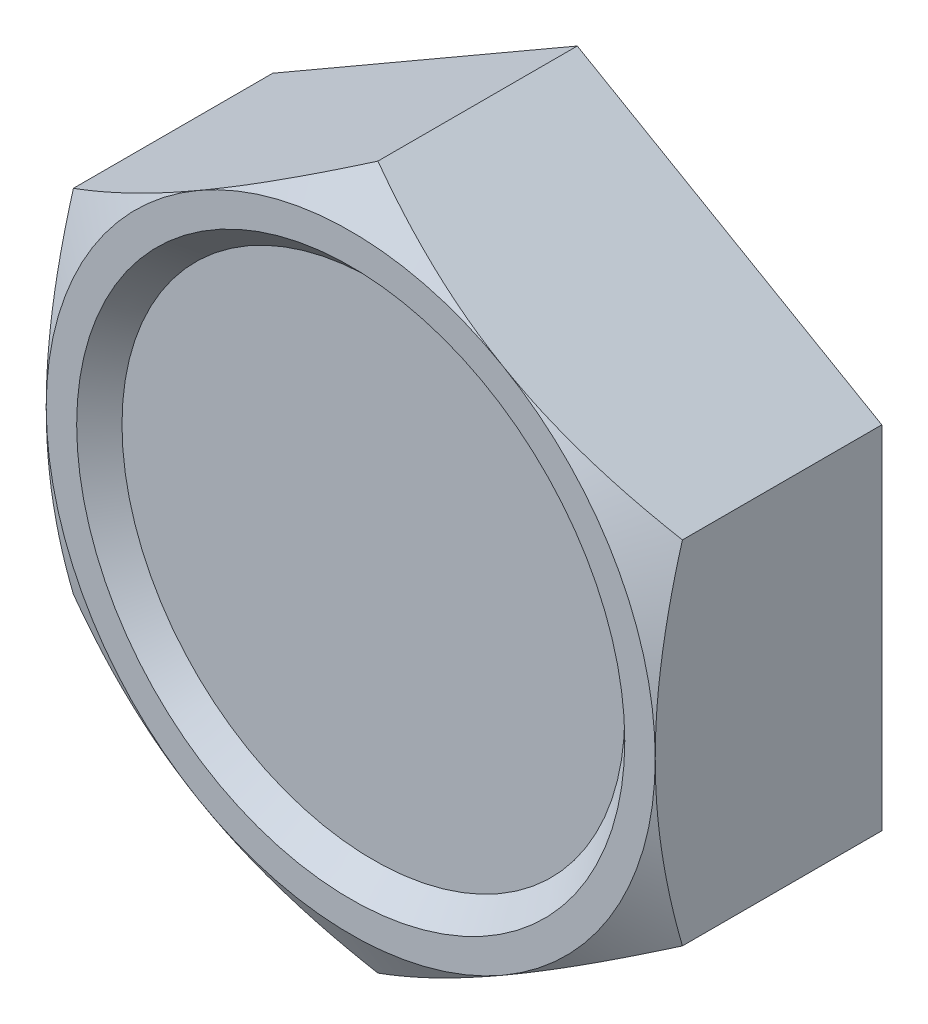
ISO-10303-21;
HEADER;
FILE_DESCRIPTION(('STEP AP214'),'2;1');
FILE_NAME('part.step','',(''),(''),'','','');
FILE_SCHEMA(('AUTOMOTIVE_DESIGN { 1 0 10303 214 1 1 1 1 }'));
ENDSEC;
DATA;
#1=APPLICATION_CONTEXT('core data for automotive mechanical design processes');
#2=APPLICATION_PROTOCOL_DEFINITION('international standard','automotive_design',2000,#1);
#3=PRODUCT_CONTEXT('',#1,'mechanical');
#4=PRODUCT('Part','Part','',(#3));
#5=PRODUCT_RELATED_PRODUCT_CATEGORY('part','',(#4));
#6=PRODUCT_DEFINITION_FORMATION('','',#4);
#7=PRODUCT_DEFINITION_CONTEXT('part definition',#1,'design');
#8=PRODUCT_DEFINITION('design','',#6,#7);
#9=PRODUCT_DEFINITION_SHAPE('','',#8);
#10=(LENGTH_UNIT() NAMED_UNIT(*) SI_UNIT(.MILLI.,.METRE.));
#11=(NAMED_UNIT(*) PLANE_ANGLE_UNIT() SI_UNIT($,.RADIAN.));
#12=(NAMED_UNIT(*) SI_UNIT($,.STERADIAN.) SOLID_ANGLE_UNIT());
#13=UNCERTAINTY_MEASURE_WITH_UNIT(LENGTH_MEASURE(1.E-05),#10,'distance_accuracy_value','');
#14=(GEOMETRIC_REPRESENTATION_CONTEXT(3) GLOBAL_UNCERTAINTY_ASSIGNED_CONTEXT((#13)) GLOBAL_UNIT_ASSIGNED_CONTEXT((#10,
#11,#12)) REPRESENTATION_CONTEXT('',''));
#15=CARTESIAN_POINT('',(0.,0.,0.));
#16=DIRECTION('',(0.,0.,1.));
#17=DIRECTION('',(1.,0.,0.));
#18=AXIS2_PLACEMENT_3D('',#15,#16,#17);
#19=CARTESIAN_POINT('',(-3.175,1.83308710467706,2.3622));
#20=DIRECTION('',(1.,0.,0.));
#21=DIRECTION('',(0.,1.,0.));
#22=AXIS2_PLACEMENT_3D('',#19,#20,#21);
#23=PLANE('',#22);
#24=CARTESIAN_POINT('',(-3.175,1.83308710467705,2.0786204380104));
#25=CARTESIAN_POINT('',(-3.17499548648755,1.75618846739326,2.10081953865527));
#26=CARTESIAN_POINT('',(-3.1749898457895,1.67900455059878,2.12205787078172));
#27=CARTESIAN_POINT('',(-3.17499165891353,1.52597562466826,2.16184857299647));
#28=CARTESIAN_POINT('',(-3.17499879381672,1.45014442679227,2.18045419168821));
#29=CARTESIAN_POINT('',(-3.17503940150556,1.29944848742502,2.21498780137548));
#30=CARTESIAN_POINT('',(-3.1750723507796,1.2245942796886,2.23096145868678));
#31=CARTESIAN_POINT('',(-3.17515866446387,1.07543574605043,2.26022942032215));
#32=CARTESIAN_POINT('',(-3.17521174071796,1.00113809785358,2.27355767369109));
#33=CARTESIAN_POINT('',(-3.17519667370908,0.848696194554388,2.29822252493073));
#34=CARTESIAN_POINT('',(-3.175122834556,0.770532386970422,2.30943911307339));
#35=CARTESIAN_POINT('',(-3.17496693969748,0.615313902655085,2.32861558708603));
#36=CARTESIAN_POINT('',(-3.17488506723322,0.538266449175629,2.33663342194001));
#37=CARTESIAN_POINT('',(-3.17482782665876,0.384545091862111,2.34941947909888));
#38=CARTESIAN_POINT('',(-3.17485157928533,0.307873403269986,2.35421414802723));
#39=CARTESIAN_POINT('',(-3.17492556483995,0.154135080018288,2.36062334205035));
#40=CARTESIAN_POINT('',(-3.17497588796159,0.0770679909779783,2.3622269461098));
#41=CARTESIAN_POINT('',(-3.175,0.,2.3622));
#42=B_SPLINE_CURVE_WITH_KNOTS('',3,(#24,#25,#26,#27,#28,#29,#30,#31,#32,#33,#34,#35,#36,#37,#38,
#39,#40,#41),.UNSPECIFIED.,.F.,.F.,(4,2,2,2,2,2,2,2,4),(0.,0.24012109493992,0.474331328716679,
0.703911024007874,0.930320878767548,1.16715902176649,1.39948712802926,1.62988488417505,
1.86106980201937),.UNSPECIFIED.);
#43=CARTESIAN_POINT('',(-3.175,1.83308710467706,2.0786204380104));
#44=VERTEX_POINT('',#43);
#45=CARTESIAN_POINT('',(-3.175,0.,2.3622));
#46=VERTEX_POINT('',#45);
#47=EDGE_CURVE('E306',#44,#46,#42,.T.);
#48=ORIENTED_EDGE('',*,*,#47,.F.);
#49=DIRECTION('',(0.,0.,-1.));
#50=VECTOR('',#49,1.);
#51=CARTESIAN_POINT('',(-3.175,1.83308710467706,2.3622));
#52=LINE('',#51,#50);
#53=CARTESIAN_POINT('',(-3.175,1.83308710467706,0.));
#54=VERTEX_POINT('',#53);
#55=EDGE_CURVE('E345',#44,#54,#52,.T.);
#56=ORIENTED_EDGE('',*,*,#55,.T.);
#57=DIRECTION('',(0.,-1.,0.));
#58=VECTOR('',#57,1.);
#59=CARTESIAN_POINT('',(-3.175,1.83308710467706,0.));
#60=LINE('',#59,#58);
#61=CARTESIAN_POINT('',(-3.175,-1.83308710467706,0.));
#62=VERTEX_POINT('',#61);
#63=EDGE_CURVE('E135',#54,#62,#60,.T.);
#64=ORIENTED_EDGE('',*,*,#63,.T.);
#65=DIRECTION('',(0.,0.,-1.));
#66=VECTOR('',#65,1.);
#67=CARTESIAN_POINT('',(-3.175,-1.83308710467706,2.3622));
#68=LINE('',#67,#66);
#69=CARTESIAN_POINT('',(-3.175,-1.83308710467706,2.0786204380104));
#70=VERTEX_POINT('',#69);
#71=EDGE_CURVE('E11',#70,#62,#68,.T.);
#72=ORIENTED_EDGE('',*,*,#71,.F.);
#73=CARTESIAN_POINT('',(-3.175,0.,2.3622));
#74=CARTESIAN_POINT('',(-3.17497594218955,-0.0770598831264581,2.36222691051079));
#75=CARTESIAN_POINT('',(-3.17492638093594,-0.154118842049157,2.3606232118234));
#76=CARTESIAN_POINT('',(-3.17485430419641,-0.307846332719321,2.35421405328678));
#77=CARTESIAN_POINT('',(-3.17483169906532,-0.384515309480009,2.34941928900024));
#78=CARTESIAN_POINT('',(-3.17489063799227,-0.538236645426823,2.33663316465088));
#79=CARTESIAN_POINT('',(-3.17497306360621,-0.615286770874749,2.32861513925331));
#80=CARTESIAN_POINT('',(-3.1751273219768,-0.770516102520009,2.309438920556));
#81=CARTESIAN_POINT('',(-3.1751989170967,-0.848688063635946,2.29822259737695));
#82=CARTESIAN_POINT('',(-3.17520959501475,-1.00113024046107,2.2735601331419));
#83=CARTESIAN_POINT('',(-3.17515439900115,-1.07542009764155,2.26023456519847));
#84=CARTESIAN_POINT('',(-3.17506645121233,-1.22456790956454,2.23097009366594));
#85=CARTESIAN_POINT('',(-3.17503402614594,-1.29941915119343,2.21499705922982));
#86=CARTESIAN_POINT('',(-3.17499503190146,-1.4501146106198,2.18046334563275));
#87=CARTESIAN_POINT('',(-3.17498899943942,-1.52594825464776,2.16185682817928));
#88=CARTESIAN_POINT('',(-3.17498904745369,-1.67898795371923,2.12206283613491));
#89=CARTESIAN_POINT('',(-3.17499543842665,-1.75618015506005,2.10082194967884));
#90=CARTESIAN_POINT('',(-3.175,-1.83308710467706,2.0786204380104));
#91=B_SPLINE_CURVE_WITH_KNOTS('',3,(#73,#74,#75,#76,#77,#78,#79,#80,#81,#82,#83,#84,#85,#86,#87,
#88,#89,#90),.UNSPECIFIED.,.F.,.F.,(4,2,2,2,2,2,2,2,4),(0.,0.231160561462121,0.461550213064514,
0.693886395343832,0.930748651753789,1.15713406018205,1.38670463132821,1.62092263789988,
1.86106971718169),.UNSPECIFIED.);
#92=EDGE_CURVE('E198',#46,#70,#91,.T.);
#93=ORIENTED_EDGE('',*,*,#92,.F.);
#94=EDGE_LOOP('',(#48,#56,#64,#72,#93));
#95=FACE_BOUND('',#94,.T.);
#96=ADVANCED_FACE('F17',(#95),#23,.F.);
#97=CARTESIAN_POINT('',(-3.175,-1.83308710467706,2.3622));
#98=DIRECTION('',(0.5,0.866025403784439,0.));
#99=DIRECTION('',(0.,0.,-1.));
#100=AXIS2_PLACEMENT_3D('',#97,#98,#99);
#101=PLANE('',#100);
#102=CARTESIAN_POINT('',(-3.175,-1.83308710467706,2.0786204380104));
#103=CARTESIAN_POINT('',(-3.10840156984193,-1.87153251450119,2.10081953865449));
#104=CARTESIAN_POINT('',(-3.04155551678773,-1.9101195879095,2.12205787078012));
#105=CARTESIAN_POINT('',(-2.90902948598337,-1.98663562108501,2.16184857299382));
#106=CARTESIAN_POINT('',(-2.8433613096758,-2.02455739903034,2.18045419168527));
#107=CARTESIAN_POINT('',(-2.71287510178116,-2.09994053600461,2.2149878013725));
#108=CARTESIAN_POINT('',(-2.64806593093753,-2.13739617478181,2.230961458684));
#109=CARTESIAN_POINT('',(-2.51893400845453,-2.21205019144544,2.2602294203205));
#110=CARTESIAN_POINT('',(-2.45461689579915,-2.2492449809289,2.2735576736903));
#111=CARTESIAN_POINT('',(-2.32259080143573,-2.32545288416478,2.29822252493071));
#112=CARTESIAN_POINT('',(-2.25486203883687,-2.36447084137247,2.30943911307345));
#113=CARTESIAN_POINT('',(-2.12036094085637,-2.44194507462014,2.32861558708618));
#114=CARTESIAN_POINT('',(-2.05359495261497,-2.48039789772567,2.33663342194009));
#115=CARTESIAN_POINT('',(-1.92043973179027,-2.5572090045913,2.34941947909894));
#116=CARTESIAN_POINT('',(-1.85405197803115,-2.59556541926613,2.35421414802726));
#117=CARTESIAN_POINT('',(-1.72094767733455,-2.67249865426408,2.36062334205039));
#118=CARTESIAN_POINT('',(-1.6542307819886,-2.71107577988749,2.36222694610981));
#119=CARTESIAN_POINT('',(-1.5875,-2.7496306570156,2.3622));
#120=B_SPLINE_CURVE_WITH_KNOTS('',3,(#102,#103,#104,#105,#106,#107,#108,#109,#110,#111,#112,
#113,#114,#115,#116,#117,#118,#119),.UNSPECIFIED.,.F.,.F.,(4,2,2,2,2,2,2,2,4),(0.,
0.240121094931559,0.474331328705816,0.703911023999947,0.930320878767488,1.16715902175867,
1.39948712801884,1.62988488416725,1.86106980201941),.UNSPECIFIED.);
#121=CARTESIAN_POINT('',(-1.5875,-2.7496306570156,2.3622));
#122=VERTEX_POINT('',#121);
#123=EDGE_CURVE('E140',#70,#122,#120,.T.);
#124=ORIENTED_EDGE('',*,*,#123,.F.);
#125=ORIENTED_EDGE('',*,*,#71,.T.);
#126=DIRECTION('',(0.866025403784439,-0.5,0.));
#127=VECTOR('',#126,1.);
#128=CARTESIAN_POINT('',(-3.175,-1.83308710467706,0.));
#129=LINE('',#128,#127);
#130=CARTESIAN_POINT('',(0.,-3.66617420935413,0.));
#131=VERTEX_POINT('',#130);
#132=EDGE_CURVE('E154',#62,#131,#129,.T.);
#133=ORIENTED_EDGE('',*,*,#132,.T.);
#134=DIRECTION('',(0.,0.,-1.));
#135=VECTOR('',#134,1.);
#136=CARTESIAN_POINT('',(0.,-3.66617420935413,2.3622));
#137=LINE('',#136,#135);
#138=CARTESIAN_POINT('',(0.,-3.66617420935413,2.0786204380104));
#139=VERTEX_POINT('',#138);
#140=EDGE_CURVE('E28',#139,#131,#137,.T.);
#141=ORIENTED_EDGE('',*,*,#140,.F.);
#142=CARTESIAN_POINT('',(-1.5875,-2.7496306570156,2.3622));
#143=CARTESIAN_POINT('',(-1.52075215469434,-2.78813976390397,2.36222691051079));
#144=CARTESIAN_POINT('',(-1.45399235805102,-2.82662632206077,2.3606232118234));
#145=CARTESIAN_POINT('',(-1.32082440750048,-2.90342764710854,2.35421405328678));
#146=CARTESIAN_POINT('',(-1.25441582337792,-2.94174255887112,2.34941928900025));
#147=CARTESIAN_POINT('',(-1.12131871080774,-3.01865426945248,2.33663316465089));
#148=CARTESIAN_POINT('',(-1.0546325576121,-3.05725071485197,2.32861513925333));
#149=CARTESIAN_POINT('',(-0.920277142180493,-3.13499897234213,2.30943892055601));
#150=CARTESIAN_POINT('',(-0.852614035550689,-3.17414695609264,2.29822259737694));
#151=CARTESIAN_POINT('',(-0.72060057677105,-3.25037729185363,2.27356013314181));
#152=CARTESIAN_POINT('',(-0.656236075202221,-3.28747441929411,2.26023456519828));
#153=CARTESIAN_POINT('',(-0.527026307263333,-3.36197216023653,2.23097009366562));
#154=CARTESIAN_POINT('',(-0.462187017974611,-3.3993697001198,2.21499705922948));
#155=CARTESIAN_POINT('',(-0.331661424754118,-3.47468365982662,2.18046334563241));
#156=CARTESIAN_POINT('',(-0.265984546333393,-3.51259525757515,2.16185682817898));
#157=CARTESIAN_POINT('',(-0.13344830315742,-3.5891151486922,2.12206283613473));
#158=CARTESIAN_POINT('',(-0.0666010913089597,-3.62771678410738,2.10082194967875));
#159=CARTESIAN_POINT('',(0.,-3.66617420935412,2.07862043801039));
#160=B_SPLINE_CURVE_WITH_KNOTS('',3,(#142,#143,#144,#145,#146,#147,#148,#149,#150,#151,#152,
#153,#154,#155,#156,#157,#158,#159),.UNSPECIFIED.,.F.,.F.,(4,2,2,2,2,2,2,2,4),(0.,
0.231160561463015,0.461550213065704,0.693886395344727,0.930748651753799,1.15713406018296,
1.38670463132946,1.62092263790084,1.86106971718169),.UNSPECIFIED.);
#161=EDGE_CURVE('E252',#122,#139,#160,.T.);
#162=ORIENTED_EDGE('',*,*,#161,.F.);
#163=EDGE_LOOP('',(#124,#125,#133,#141,#162));
#164=FACE_BOUND('',#163,.T.);
#165=ADVANCED_FACE('F258',(#164),#101,.F.);
#166=CARTESIAN_POINT('',(0.,-3.66617420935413,2.3622));
#167=DIRECTION('',(-0.5,0.866025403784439,0.));
#168=DIRECTION('',(0.,0.,1.));
#169=AXIS2_PLACEMENT_3D('',#166,#167,#168);
#170=PLANE('',#169);
#171=CARTESIAN_POINT('',(0.,-3.66617420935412,2.07862043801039));
#172=CARTESIAN_POINT('',(0.0665939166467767,-3.62772098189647,2.10081953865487));
#173=CARTESIAN_POINT('',(0.133434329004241,-3.58912413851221,2.12205787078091));
#174=CARTESIAN_POINT('',(0.265962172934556,-3.51261124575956,2.16184857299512));
#175=CARTESIAN_POINT('',(0.331637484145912,-3.47470182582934,2.18045419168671));
#176=CARTESIAN_POINT('',(0.462164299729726,-3.39938902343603,2.21498780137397));
#177=CARTESIAN_POINT('',(0.527006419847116,-3.36199045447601,2.23096145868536));
#178=CARTESIAN_POINT('',(0.656224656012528,-3.28748593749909,2.26022942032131));
#179=CARTESIAN_POINT('',(0.720594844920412,-3.2503830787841,2.27355767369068));
#180=CARTESIAN_POINT('',(0.852605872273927,-3.17414907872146,2.29822252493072));
#181=CARTESIAN_POINT('',(0.920260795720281,-3.13500322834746,2.30943911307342));
#182=CARTESIAN_POINT('',(1.05460599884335,-3.05725897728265,2.32861558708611));
#183=CARTESIAN_POINT('',(1.121290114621,-3.0186643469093,2.33663342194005));
#184=CARTESIAN_POINT('',(1.25438809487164,-2.94175409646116,2.34941947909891));
#185=CARTESIAN_POINT('',(1.32079960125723,-2.90343882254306,2.35421414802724));
#186=CARTESIAN_POINT('',(1.45397788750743,-2.8266337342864,2.36062334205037));
#187=CARTESIAN_POINT('',(1.52074510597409,-2.78814377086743,2.36222694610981));
#188=CARTESIAN_POINT('',(1.5875,-2.74963065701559,2.3622));
#189=B_SPLINE_CURVE_WITH_KNOTS('',3,(#171,#172,#173,#174,#175,#176,#177,#178,#179,#180,#181,
#182,#183,#184,#185,#186,#187,#188),.UNSPECIFIED.,.F.,.F.,(4,2,2,2,2,2,2,2,4),(0.,
0.240121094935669,0.474331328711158,0.703911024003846,0.93032087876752,1.16715902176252,
1.39948712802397,1.6298848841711,1.8610698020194),.UNSPECIFIED.);
#190=CARTESIAN_POINT('',(1.5875,-2.74963065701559,2.3622));
#191=VERTEX_POINT('',#190);
#192=EDGE_CURVE('E218',#139,#191,#189,.T.);
#193=ORIENTED_EDGE('',*,*,#192,.F.);
#194=ORIENTED_EDGE('',*,*,#140,.T.);
#195=DIRECTION('',(0.866025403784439,0.5,0.));
#196=VECTOR('',#195,1.);
#197=CARTESIAN_POINT('',(0.,-3.66617420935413,0.));
#198=LINE('',#197,#196);
#199=CARTESIAN_POINT('',(3.175,-1.83308710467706,0.));
#200=VERTEX_POINT('',#199);
#201=EDGE_CURVE('E151',#131,#200,#198,.T.);
#202=ORIENTED_EDGE('',*,*,#201,.T.);
#203=DIRECTION('',(0.,0.,-1.));
#204=VECTOR('',#203,1.);
#205=CARTESIAN_POINT('',(3.175,-1.83308710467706,2.3622));
#206=LINE('',#205,#204);
#207=CARTESIAN_POINT('',(3.17499999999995,-1.83308710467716,2.0786204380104));
#208=VERTEX_POINT('',#207);
#209=EDGE_CURVE('E50',#208,#200,#206,.T.);
#210=ORIENTED_EDGE('',*,*,#209,.F.);
#211=CARTESIAN_POINT('',(1.5875,-2.74963065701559,2.3622));
#212=CARTESIAN_POINT('',(1.65422378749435,-2.71107988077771,2.36222691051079));
#213=CARTESIAN_POINT('',(1.7209340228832,-2.6725074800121,2.36062321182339));
#214=CARTESIAN_POINT('',(1.85402989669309,-2.59558131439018,2.35421405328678));
#215=CARTESIAN_POINT('',(1.9204158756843,-2.55722724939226,2.34941928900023));
#216=CARTESIAN_POINT('',(2.05357192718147,-2.480417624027,2.33663316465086));
#217=CARTESIAN_POINT('',(2.12034050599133,-2.44196394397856,2.32861513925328));
#218=CARTESIAN_POINT('',(2.25485017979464,-2.36448286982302,2.30943892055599));
#219=CARTESIAN_POINT('',(2.32258488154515,-2.32545889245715,2.29822259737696));
#220=CARTESIAN_POINT('',(2.45460901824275,-2.24924705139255,2.27356013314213));
#221=CARTESIAN_POINT('',(2.51891832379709,-2.21205432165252,2.26023456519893));
#222=CARTESIAN_POINT('',(2.64804014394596,-2.13740425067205,2.23097009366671));
#223=CARTESIAN_POINT('',(2.71284700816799,-2.09995054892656,2.21499705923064));
#224=CARTESIAN_POINT('',(2.84333360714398,-2.0245690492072,2.18046334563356));
#225=CARTESIAN_POINT('',(2.90900445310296,-1.98664700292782,2.16185682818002));
#226=CARTESIAN_POINT('',(3.04154074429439,-1.91012719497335,2.12206283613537));
#227=CARTESIAN_POINT('',(3.1083943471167,-1.87153662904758,2.10082194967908));
#228=CARTESIAN_POINT('',(3.1749999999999,-1.83308710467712,2.07862043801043));
#229=B_SPLINE_CURVE_WITH_KNOTS('',3,(#211,#212,#213,#214,#215,#216,#217,#218,#219,#220,#221,
#222,#223,#224,#225,#226,#227,#228),.UNSPECIFIED.,.F.,.F.,(4,2,2,2,2,2,2,2,4),(0.,
0.231160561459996,0.461550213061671,0.69388639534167,0.930748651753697,1.15713406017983,
1.38670463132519,1.62092263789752,1.86106971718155),.UNSPECIFIED.);
#230=EDGE_CURVE('E422',#191,#208,#229,.T.);
#231=ORIENTED_EDGE('',*,*,#230,.F.);
#232=EDGE_LOOP('',(#193,#194,#202,#210,#231));
#233=FACE_BOUND('',#232,.T.);
#234=ADVANCED_FACE('F266',(#233),#170,.F.);
#235=CARTESIAN_POINT('',(3.175,-1.83308710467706,2.3622));
#236=DIRECTION('',(-1.,0.,0.));
#237=DIRECTION('',(0.,0.,1.));
#238=AXIS2_PLACEMENT_3D('',#235,#236,#237);
#239=PLANE('',#238);
#240=CARTESIAN_POINT('',(3.175,-1.8330871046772,2.07862043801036));
#241=CARTESIAN_POINT('',(3.17499548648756,-1.75618846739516,2.10081953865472));
#242=CARTESIAN_POINT('',(3.17498984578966,-1.67900455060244,2.12205787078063));
#243=CARTESIAN_POINT('',(3.17499165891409,-1.52597562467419,2.16184857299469));
#244=CARTESIAN_POINT('',(3.17499879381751,-1.45014442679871,2.18045419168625));
#245=CARTESIAN_POINT('',(3.1750394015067,-1.29944848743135,2.2149878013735));
#246=CARTESIAN_POINT('',(3.17507235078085,-1.22459427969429,2.23096145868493));
#247=CARTESIAN_POINT('',(3.17515866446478,-1.07543574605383,2.26022942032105));
#248=CARTESIAN_POINT('',(3.17521174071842,-1.00113809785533,2.27355767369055));
#249=CARTESIAN_POINT('',(3.17519667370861,-0.84869619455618,2.29822252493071));
#250=CARTESIAN_POINT('',(3.17512283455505,-0.770532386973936,2.30943911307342));
#251=CARTESIAN_POINT('',(3.17496693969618,-0.615313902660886,2.32861558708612));
#252=CARTESIAN_POINT('',(3.17488506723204,-0.538266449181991,2.33663342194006));
#253=CARTESIAN_POINT('',(3.17482782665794,-0.384545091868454,2.34941947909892));
#254=CARTESIAN_POINT('',(3.17485157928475,-0.307873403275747,2.35421414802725));
#255=CARTESIAN_POINT('',(3.17492556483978,-0.154135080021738,2.36062334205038));
#256=CARTESIAN_POINT('',(3.17497588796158,-0.0770679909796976,2.36222694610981));
#257=CARTESIAN_POINT('',(3.175,0.,2.3622));
#258=B_SPLINE_CURVE_WITH_KNOTS('',3,(#240,#241,#242,#243,#244,#245,#246,#247,#248,#249,#250,
#251,#252,#253,#254,#255,#256,#257),.UNSPECIFIED.,.F.,.F.,(4,2,2,2,2,2,2,2,4),(0.,
0.240121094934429,0.474331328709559,0.703911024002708,0.930320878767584,1.16715902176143,
1.39948712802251,1.62988488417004,1.86106980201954),.UNSPECIFIED.);
#259=CARTESIAN_POINT('',(3.175,0.,2.3622));
#260=VERTEX_POINT('',#259);
#261=EDGE_CURVE('E490',#208,#260,#258,.T.);
#262=ORIENTED_EDGE('',*,*,#261,.F.);
#263=ORIENTED_EDGE('',*,*,#209,.T.);
#264=DIRECTION('',(0.,1.,0.));
#265=VECTOR('',#264,1.);
#266=CARTESIAN_POINT('',(3.175,-1.83308710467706,0.));
#267=LINE('',#266,#265);
#268=CARTESIAN_POINT('',(3.175,1.83308710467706,0.));
#269=VERTEX_POINT('',#268);
#270=EDGE_CURVE('E148',#200,#269,#267,.T.);
#271=ORIENTED_EDGE('',*,*,#270,.T.);
#272=DIRECTION('',(0.,0.,-1.));
#273=VECTOR('',#272,1.);
#274=CARTESIAN_POINT('',(3.175,1.83308710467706,2.3622));
#275=LINE('',#274,#273);
#276=CARTESIAN_POINT('',(3.175,1.83308710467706,2.0786204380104));
#277=VERTEX_POINT('',#276);
#278=EDGE_CURVE('E452',#277,#269,#275,.T.);
#279=ORIENTED_EDGE('',*,*,#278,.F.);
#280=CARTESIAN_POINT('',(3.175,0.,2.3622));
#281=CARTESIAN_POINT('',(3.17497594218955,0.0770598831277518,2.3622269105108));
#282=CARTESIAN_POINT('',(3.17492638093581,0.154118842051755,2.36062321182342));
#283=CARTESIAN_POINT('',(3.17485430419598,0.307846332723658,2.3542140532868));
#284=CARTESIAN_POINT('',(3.1748316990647,0.384515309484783,2.34941928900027));
#285=CARTESIAN_POINT('',(3.17489063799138,0.538236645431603,2.33663316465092));
#286=CARTESIAN_POINT('',(3.17497306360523,0.615286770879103,2.32861513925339));
#287=CARTESIAN_POINT('',(3.17512732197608,0.770516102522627,2.30943892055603));
#288=CARTESIAN_POINT('',(3.17519891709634,0.848688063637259,2.29822259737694));
#289=CARTESIAN_POINT('',(3.17520959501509,1.00113024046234,2.27356013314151));
#290=CARTESIAN_POINT('',(3.17515439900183,1.07542009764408,2.26023456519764));
#291=CARTESIAN_POINT('',(3.17506645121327,1.22456790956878,2.23097009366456));
#292=CARTESIAN_POINT('',(3.1750340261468,1.29941915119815,2.21499705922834));
#293=CARTESIAN_POINT('',(3.17499503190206,1.45011461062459,2.18046334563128));
#294=CARTESIAN_POINT('',(3.17498899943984,1.52594825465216,2.16185682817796));
#295=CARTESIAN_POINT('',(3.17498904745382,1.6789879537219,2.12206283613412));
#296=CARTESIAN_POINT('',(3.17499543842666,1.75618015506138,2.10082194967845));
#297=CARTESIAN_POINT('',(3.175,1.83308710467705,2.0786204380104));
#298=B_SPLINE_CURVE_WITH_KNOTS('',3,(#280,#281,#282,#283,#284,#285,#286,#287,#288,#289,#290,
#291,#292,#293,#294,#295,#296,#297),.UNSPECIFIED.,.F.,.F.,(4,2,2,2,2,2,2,2,4),(0.,
0.231160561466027,0.461550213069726,0.693886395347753,0.930748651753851,1.15713406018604,
1.38670463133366,1.62092263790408,1.86106971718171),.UNSPECIFIED.);
#299=EDGE_CURVE('E466',#260,#277,#298,.T.);
#300=ORIENTED_EDGE('',*,*,#299,.F.);
#301=EDGE_LOOP('',(#262,#263,#271,#279,#300));
#302=FACE_BOUND('',#301,.T.);
#303=ADVANCED_FACE('F355',(#302),#239,.F.);
#304=CARTESIAN_POINT('',(3.175,1.83308710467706,2.3622));
#305=DIRECTION('',(-0.5,-0.866025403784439,0.));
#306=DIRECTION('',(-0.866025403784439,0.5,0.));
#307=AXIS2_PLACEMENT_3D('',#304,#305,#306);
#308=PLANE('',#307);
#309=CARTESIAN_POINT('',(3.175,1.83308710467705,2.0786204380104));
#310=CARTESIAN_POINT('',(3.10840156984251,1.87153251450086,2.1008195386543));
#311=CARTESIAN_POINT('',(3.04155551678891,1.91011958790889,2.12205787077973));
#312=CARTESIAN_POINT('',(2.90902948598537,1.9866356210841,2.16184857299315));
#313=CARTESIAN_POINT('',(2.84336130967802,2.02455739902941,2.18045419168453));
#314=CARTESIAN_POINT('',(2.71287510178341,2.09994053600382,2.21498780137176));
#315=CARTESIAN_POINT('',(2.64806593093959,2.13739617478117,2.23096145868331));
#316=CARTESIAN_POINT('',(2.51893400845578,2.21205019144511,2.26022942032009));
#317=CARTESIAN_POINT('',(2.45461689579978,2.24924498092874,2.2735576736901));
#318=CARTESIAN_POINT('',(2.3225908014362,2.32545288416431,2.2982225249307));
#319=CARTESIAN_POINT('',(2.25486203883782,2.3644708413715,2.30943911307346));
#320=CARTESIAN_POINT('',(2.12036094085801,2.44194507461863,2.32861558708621));
#321=CARTESIAN_POINT('',(2.05359495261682,2.48039789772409,2.33663342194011));
#322=CARTESIAN_POINT('',(1.92043973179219,2.55720900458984,2.34941947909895));
#323=CARTESIAN_POINT('',(1.85405197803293,2.59556541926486,2.35421414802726));
#324=CARTESIAN_POINT('',(1.72094767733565,2.67249865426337,2.3606233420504));
#325=CARTESIAN_POINT('',(1.65423078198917,2.71107577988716,2.36222694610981));
#326=CARTESIAN_POINT('',(1.58750000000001,2.7496306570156,2.3622));
#327=B_SPLINE_CURVE_WITH_KNOTS('',3,(#309,#310,#311,#312,#313,#314,#315,#316,#317,#318,#319,
#320,#321,#322,#323,#324,#325,#326),.UNSPECIFIED.,.F.,.F.,(4,2,2,2,2,2,2,2,4),(0.,
0.240121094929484,0.474331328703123,0.70391102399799,0.930320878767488,1.16715902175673,
1.39948712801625,1.6298848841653,1.86106980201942),.UNSPECIFIED.);
#328=CARTESIAN_POINT('',(1.5875,2.7496306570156,2.3622));
#329=VERTEX_POINT('',#328);
#330=EDGE_CURVE('E395',#277,#329,#327,.T.);
#331=ORIENTED_EDGE('',*,*,#330,.F.);
#332=ORIENTED_EDGE('',*,*,#278,.T.);
#333=DIRECTION('',(-0.866025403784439,0.5,0.));
#334=VECTOR('',#333,1.);
#335=CARTESIAN_POINT('',(3.175,1.83308710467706,0.));
#336=LINE('',#335,#334);
#337=CARTESIAN_POINT('',(0.,3.66617420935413,0.));
#338=VERTEX_POINT('',#337);
#339=EDGE_CURVE('E144',#269,#338,#336,.T.);
#340=ORIENTED_EDGE('',*,*,#339,.T.);
#341=DIRECTION('',(0.,0.,-1.));
#342=VECTOR('',#341,1.);
#343=CARTESIAN_POINT('',(0.,3.66617420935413,2.3622));
#344=LINE('',#343,#342);
#345=CARTESIAN_POINT('',(0.,3.66617420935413,2.0786204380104));
#346=VERTEX_POINT('',#345);
#347=EDGE_CURVE('E157',#346,#338,#344,.T.);
#348=ORIENTED_EDGE('',*,*,#347,.F.);
#349=CARTESIAN_POINT('',(1.58750000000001,2.7496306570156,2.3622));
#350=CARTESIAN_POINT('',(1.52075215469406,2.78813976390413,2.36222691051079));
#351=CARTESIAN_POINT('',(1.45399235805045,2.82662632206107,2.36062321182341));
#352=CARTESIAN_POINT('',(1.3208244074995,2.90342764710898,2.35421405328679));
#353=CARTESIAN_POINT('',(1.25441582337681,2.94174255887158,2.34941928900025));
#354=CARTESIAN_POINT('',(1.1213187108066,3.01865426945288,2.3366331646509));
#355=CARTESIAN_POINT('',(1.05463255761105,3.0572507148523,2.32861513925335));
#356=CARTESIAN_POINT('',(0.920277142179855,3.1349989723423,2.30943892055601));
#357=CARTESIAN_POINT('',(0.852614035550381,3.17414695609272,2.29822259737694));
#358=CARTESIAN_POINT('',(0.720600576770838,3.25037729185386,2.27356013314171));
#359=CARTESIAN_POINT('',(0.656236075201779,3.28747441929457,2.26023456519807));
#360=CARTESIAN_POINT('',(0.527026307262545,3.36197216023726,2.23097009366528));
#361=CARTESIAN_POINT('',(0.462187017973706,3.39936970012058,2.21499705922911));
#362=CARTESIAN_POINT('',(0.33166142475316,3.47468365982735,2.18046334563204));
#363=CARTESIAN_POINT('',(0.265984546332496,3.51259525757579,2.16185682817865));
#364=CARTESIAN_POINT('',(0.133448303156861,3.58911514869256,2.12206283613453));
#365=CARTESIAN_POINT('',(0.0666010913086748,3.62771678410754,2.10082194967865));
#366=CARTESIAN_POINT('',(0.,3.66617420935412,2.07862043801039));
#367=B_SPLINE_CURVE_WITH_KNOTS('',3,(#349,#350,#351,#352,#353,#354,#355,#356,#357,#358,#359,
#360,#361,#362,#363,#364,#365,#366),.UNSPECIFIED.,.F.,.F.,(4,2,2,2,2,2,2,2,4),(0.,
0.231160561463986,0.461550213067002,0.693886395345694,0.930748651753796,1.15713406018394,
1.38670463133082,1.62092263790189,1.8610697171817),.UNSPECIFIED.);
#368=EDGE_CURVE('E377',#329,#346,#367,.T.);
#369=ORIENTED_EDGE('',*,*,#368,.F.);
#370=EDGE_LOOP('',(#331,#332,#340,#348,#369));
#371=FACE_BOUND('',#370,.T.);
#372=ADVANCED_FACE('F267',(#371),#308,.F.);
#373=CARTESIAN_POINT('',(0.,3.66617420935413,2.3622));
#374=DIRECTION('',(0.5,-0.866025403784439,0.));
#375=DIRECTION('',(0.,0.,-1.));
#376=AXIS2_PLACEMENT_3D('',#373,#374,#375);
#377=PLANE('',#376);
#378=CARTESIAN_POINT('',(0.,3.66617420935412,2.07862043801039));
#379=CARTESIAN_POINT('',(-0.0665939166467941,3.62772098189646,2.10081953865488));
#380=CARTESIAN_POINT('',(-0.13343432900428,3.58912413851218,2.12205787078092));
#381=CARTESIAN_POINT('',(-0.26596217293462,3.51261124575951,2.16184857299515));
#382=CARTESIAN_POINT('',(-0.331637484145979,3.47470182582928,2.18045419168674));
#383=CARTESIAN_POINT('',(-0.462164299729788,3.39938902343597,2.214987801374));
#384=CARTESIAN_POINT('',(-0.52700641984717,3.36199045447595,2.23096145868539));
#385=CARTESIAN_POINT('',(-0.656224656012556,3.28748593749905,2.26022942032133));
#386=CARTESIAN_POINT('',(-0.720594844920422,3.25038307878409,2.27355767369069));
#387=CARTESIAN_POINT('',(-0.852605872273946,3.17414907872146,2.29822252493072));
#388=CARTESIAN_POINT('',(-0.920260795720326,3.13500322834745,2.30943911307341));
#389=CARTESIAN_POINT('',(-1.05460599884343,3.05725897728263,2.3286155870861));
#390=CARTESIAN_POINT('',(-1.12129011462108,3.01866434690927,2.33663342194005));
#391=CARTESIAN_POINT('',(-1.25438809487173,2.94175409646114,2.34941947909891));
#392=CARTESIAN_POINT('',(-1.32079960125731,2.90343882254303,2.35421414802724));
#393=CARTESIAN_POINT('',(-1.45397788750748,2.82663373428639,2.36062334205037));
#394=CARTESIAN_POINT('',(-1.52074510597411,2.78814377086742,2.3622269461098));
#395=CARTESIAN_POINT('',(-1.58750000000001,2.7496306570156,2.3622));
#396=B_SPLINE_CURVE_WITH_KNOTS('',3,(#378,#379,#380,#381,#382,#383,#384,#385,#386,#387,#388,
#389,#390,#391,#392,#393,#394,#395),.UNSPECIFIED.,.F.,.F.,(4,2,2,2,2,2,2,2,4),(0.,
0.240121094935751,0.474331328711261,0.703911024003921,0.930320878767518,1.1671590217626,
1.39948712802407,1.62988488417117,1.8610698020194),.UNSPECIFIED.);
#397=CARTESIAN_POINT('',(-1.5875,2.7496306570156,2.3622));
#398=VERTEX_POINT('',#397);
#399=EDGE_CURVE('E399',#346,#398,#396,.T.);
#400=ORIENTED_EDGE('',*,*,#399,.F.);
#401=ORIENTED_EDGE('',*,*,#347,.T.);
#402=DIRECTION('',(-0.866025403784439,-0.5,0.));
#403=VECTOR('',#402,1.);
#404=CARTESIAN_POINT('',(0.,3.66617420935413,0.));
#405=LINE('',#404,#403);
#406=EDGE_CURVE('E139',#338,#54,#405,.T.);
#407=ORIENTED_EDGE('',*,*,#406,.T.);
#408=ORIENTED_EDGE('',*,*,#55,.F.);
#409=CARTESIAN_POINT('',(-1.58750000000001,2.7496306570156,2.3622));
#410=CARTESIAN_POINT('',(-1.65422378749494,2.71107988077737,2.36222691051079));
#411=CARTESIAN_POINT('',(-1.72093402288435,2.67250748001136,2.3606232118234));
#412=CARTESIAN_POINT('',(-1.85402989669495,2.59558131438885,2.35421405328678));
#413=CARTESIAN_POINT('',(-1.92041587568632,2.55722724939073,2.34941928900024));
#414=CARTESIAN_POINT('',(-2.05357192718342,2.48041762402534,2.33663316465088));
#415=CARTESIAN_POINT('',(-2.12034050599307,2.44196394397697,2.32861513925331));
#416=CARTESIAN_POINT('',(-2.25485017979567,2.364482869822,2.309438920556));
#417=CARTESIAN_POINT('',(-2.32258488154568,2.32545889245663,2.29822259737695));
#418=CARTESIAN_POINT('',(-2.45460901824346,2.24924705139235,2.27356013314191));
#419=CARTESIAN_POINT('',(-2.51891832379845,2.21205432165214,2.26023456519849));
#420=CARTESIAN_POINT('',(-2.64804014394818,2.13740425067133,2.23097009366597));
#421=CARTESIAN_POINT('',(-2.71284700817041,2.09995054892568,2.21499705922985));
#422=CARTESIAN_POINT('',(-2.84333360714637,2.02456904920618,2.18046334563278));
#423=CARTESIAN_POINT('',(-2.90900445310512,1.98664700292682,2.16185682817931));
#424=CARTESIAN_POINT('',(-3.04154074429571,1.91012719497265,2.12206283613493));
#425=CARTESIAN_POINT('',(-3.1083943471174,1.87153662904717,2.10082194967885));
#426=CARTESIAN_POINT('',(-3.175,1.83308710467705,2.0786204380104));
#427=B_SPLINE_CURVE_WITH_KNOTS('',3,(#409,#410,#411,#412,#413,#414,#415,#416,#417,#418,#419,
#420,#421,#422,#423,#424,#425,#426),.UNSPECIFIED.,.F.,.F.,(4,2,2,2,2,2,2,2,4),(0.,
0.231160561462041,0.461550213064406,0.693886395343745,0.930748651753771,1.15713406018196,
1.3867046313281,1.6209226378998,1.86106971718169),.UNSPECIFIED.);
#428=EDGE_CURVE('E304',#398,#44,#427,.T.);
#429=ORIENTED_EDGE('',*,*,#428,.F.);
#430=EDGE_LOOP('',(#400,#401,#407,#408,#429));
#431=FACE_BOUND('',#430,.T.);
#432=ADVANCED_FACE('F346',(#431),#377,.F.);
#433=CARTESIAN_POINT('',(-3.175,5.49926131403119,0.));
#434=DIRECTION('',(0.,0.,-1.));
#435=DIRECTION('',(0.,-1.,0.));
#436=AXIS2_PLACEMENT_3D('',#433,#434,#435);
#437=PLANE('',#436);
#438=ORIENTED_EDGE('',*,*,#63,.F.);
#439=ORIENTED_EDGE('',*,*,#406,.F.);
#440=ORIENTED_EDGE('',*,*,#339,.F.);
#441=ORIENTED_EDGE('',*,*,#270,.F.);
#442=ORIENTED_EDGE('',*,*,#201,.F.);
#443=ORIENTED_EDGE('',*,*,#132,.F.);
#444=EDGE_LOOP('',(#438,#439,#440,#441,#442,#443));
#445=FACE_BOUND('',#444,.T.);
#446=ADVANCED_FACE('F180',(#445),#437,.T.);
#447=CARTESIAN_POINT('',(0.,0.,2.3622));
#448=DIRECTION('',(0.,0.,-1.));
#449=DIRECTION('',(1.,0.,0.));
#450=AXIS2_PLACEMENT_3D('',#447,#448,#449);
#451=CONICAL_SURFACE('',#450,3.175,1.0471975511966);
#452=ORIENTED_EDGE('',*,*,#92,.T.);
#453=ORIENTED_EDGE('',*,*,#123,.T.);
#454=CARTESIAN_POINT('',(0.,0.,2.3622));
#455=DIRECTION('',(0.,0.,-1.));
#456=DIRECTION('',(-1.,0.,0.));
#457=AXIS2_PLACEMENT_3D('',#454,#455,#456);
#458=CIRCLE('',#457,3.175);
#459=EDGE_CURVE('E211',#122,#46,#458,.T.);
#460=ORIENTED_EDGE('',*,*,#459,.T.);
#461=EDGE_LOOP('',(#452,#453,#460));
#462=FACE_BOUND('',#461,.T.);
#463=ADVANCED_FACE('F169',(#462),#451,.T.);
#464=CARTESIAN_POINT('',(0.,0.,2.3622));
#465=DIRECTION('',(0.,0.,-1.));
#466=DIRECTION('',(1.,0.,0.));
#467=AXIS2_PLACEMENT_3D('',#464,#465,#466);
#468=CONICAL_SURFACE('',#467,3.175,1.0471975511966);
#469=ORIENTED_EDGE('',*,*,#161,.T.);
#470=ORIENTED_EDGE('',*,*,#192,.T.);
#471=CARTESIAN_POINT('',(0.,0.,2.3622));
#472=DIRECTION('',(0.,0.,-1.));
#473=DIRECTION('',(-1.,0.,0.));
#474=AXIS2_PLACEMENT_3D('',#471,#472,#473);
#475=CIRCLE('',#474,3.175);
#476=EDGE_CURVE('E281',#191,#122,#475,.T.);
#477=ORIENTED_EDGE('',*,*,#476,.T.);
#478=EDGE_LOOP('',(#469,#470,#477));
#479=FACE_BOUND('',#478,.T.);
#480=ADVANCED_FACE('F179',(#479),#468,.T.);
#481=CARTESIAN_POINT('',(0.,0.,2.3622));
#482=DIRECTION('',(0.,0.,-1.));
#483=DIRECTION('',(1.,0.,0.));
#484=AXIS2_PLACEMENT_3D('',#481,#482,#483);
#485=CONICAL_SURFACE('',#484,3.175,1.0471975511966);
#486=ORIENTED_EDGE('',*,*,#230,.T.);
#487=ORIENTED_EDGE('',*,*,#261,.T.);
#488=CARTESIAN_POINT('',(0.,0.,2.3622));
#489=DIRECTION('',(0.,0.,-1.));
#490=DIRECTION('',(-1.,0.,0.));
#491=AXIS2_PLACEMENT_3D('',#488,#489,#490);
#492=CIRCLE('',#491,3.175);
#493=EDGE_CURVE('E284',#260,#191,#492,.T.);
#494=ORIENTED_EDGE('',*,*,#493,.T.);
#495=EDGE_LOOP('',(#486,#487,#494));
#496=FACE_BOUND('',#495,.T.);
#497=ADVANCED_FACE('F234',(#496),#485,.T.);
#498=CARTESIAN_POINT('',(0.,0.,2.3622));
#499=DIRECTION('',(0.,0.,-1.));
#500=DIRECTION('',(1.,0.,0.));
#501=AXIS2_PLACEMENT_3D('',#498,#499,#500);
#502=CONICAL_SURFACE('',#501,3.175,1.0471975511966);
#503=ORIENTED_EDGE('',*,*,#299,.T.);
#504=ORIENTED_EDGE('',*,*,#330,.T.);
#505=CARTESIAN_POINT('',(0.,0.,2.3622));
#506=DIRECTION('',(0.,0.,1.));
#507=DIRECTION('',(1.,0.,0.));
#508=AXIS2_PLACEMENT_3D('',#505,#506,#507);
#509=CIRCLE('',#508,3.175);
#510=EDGE_CURVE('E402',#260,#329,#509,.T.);
#511=ORIENTED_EDGE('',*,*,#510,.F.);
#512=EDGE_LOOP('',(#503,#504,#511));
#513=FACE_BOUND('',#512,.T.);
#514=ADVANCED_FACE('F327',(#513),#502,.T.);
#515=CARTESIAN_POINT('',(0.,0.,2.3622));
#516=DIRECTION('',(0.,0.,-1.));
#517=DIRECTION('',(1.,0.,0.));
#518=AXIS2_PLACEMENT_3D('',#515,#516,#517);
#519=CONICAL_SURFACE('',#518,3.175,1.0471975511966);
#520=ORIENTED_EDGE('',*,*,#368,.T.);
#521=ORIENTED_EDGE('',*,*,#399,.T.);
#522=CARTESIAN_POINT('',(0.,0.,2.3622));
#523=DIRECTION('',(0.,0.,-1.));
#524=DIRECTION('',(-1.,0.,0.));
#525=AXIS2_PLACEMENT_3D('',#522,#523,#524);
#526=CIRCLE('',#525,3.175);
#527=EDGE_CURVE('E299',#398,#329,#526,.T.);
#528=ORIENTED_EDGE('',*,*,#527,.T.);
#529=EDGE_LOOP('',(#520,#521,#528));
#530=FACE_BOUND('',#529,.T.);
#531=ADVANCED_FACE('F324',(#530),#519,.T.);
#532=CARTESIAN_POINT('',(0.,0.,2.3622));
#533=DIRECTION('',(0.,0.,-1.));
#534=DIRECTION('',(1.,0.,0.));
#535=AXIS2_PLACEMENT_3D('',#532,#533,#534);
#536=CONICAL_SURFACE('',#535,3.175,1.0471975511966);
#537=ORIENTED_EDGE('',*,*,#47,.T.);
#538=CARTESIAN_POINT('',(0.,0.,2.3622));
#539=DIRECTION('',(0.,0.,-1.));
#540=DIRECTION('',(-1.,0.,0.));
#541=AXIS2_PLACEMENT_3D('',#538,#539,#540);
#542=CIRCLE('',#541,3.175);
#543=EDGE_CURVE('E132',#46,#398,#542,.T.);
#544=ORIENTED_EDGE('',*,*,#543,.T.);
#545=ORIENTED_EDGE('',*,*,#428,.T.);
#546=EDGE_LOOP('',(#537,#544,#545));
#547=FACE_BOUND('',#546,.T.);
#548=ADVANCED_FACE('F302',(#547),#536,.T.);
#549=CARTESIAN_POINT('',(-3.175,5.49926131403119,2.3622));
#550=DIRECTION('',(0.,0.,-1.));
#551=DIRECTION('',(0.,-1.,0.));
#552=AXIS2_PLACEMENT_3D('',#549,#550,#551);
#553=PLANE('',#552);
#554=CARTESIAN_POINT('',(0.,0.,2.3622));
#555=DIRECTION('',(0.,0.,1.));
#556=DIRECTION('',(1.,0.,0.));
#557=AXIS2_PLACEMENT_3D('',#554,#555,#556);
#558=CIRCLE('',#557,2.8575);
#559=CARTESIAN_POINT('',(2.8575,0.,2.3622));
#560=VERTEX_POINT('',#559);
#561=EDGE_CURVE('E126',#560,#560,#558,.T.);
#562=ORIENTED_EDGE('',*,*,#561,.F.);
#563=EDGE_LOOP('',(#562));
#564=FACE_BOUND('',#563,.T.);
#565=ORIENTED_EDGE('',*,*,#543,.F.);
#566=ORIENTED_EDGE('',*,*,#459,.F.);
#567=ORIENTED_EDGE('',*,*,#476,.F.);
#568=ORIENTED_EDGE('',*,*,#493,.F.);
#569=ORIENTED_EDGE('',*,*,#510,.T.);
#570=ORIENTED_EDGE('',*,*,#527,.F.);
#571=EDGE_LOOP('',(#565,#566,#567,#568,#569,#570));
#572=FACE_BOUND('',#571,.T.);
#573=ADVANCED_FACE('F296',(#564,#572),#553,.F.);
#574=CARTESIAN_POINT('',(0.,0.,2.3622));
#575=DIRECTION('',(0.,0.,1.));
#576=DIRECTION('',(1.,0.,0.));
#577=AXIS2_PLACEMENT_3D('',#574,#575,#576);
#578=CONICAL_SURFACE('',#577,2.8575,0.78539816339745);
#579=CARTESIAN_POINT('',(0.,0.,2.12598));
#580=DIRECTION('',(0.,0.,1.));
#581=DIRECTION('',(1.,0.,0.));
#582=AXIS2_PLACEMENT_3D('',#579,#580,#581);
#583=CIRCLE('',#582,2.62128);
#584=CARTESIAN_POINT('',(2.62128,0.,2.12598));
#585=VERTEX_POINT('',#584);
#586=EDGE_CURVE('E122',#585,#585,#583,.T.);
#587=ORIENTED_EDGE('',*,*,#586,.F.);
#588=EDGE_LOOP('',(#587));
#589=FACE_BOUND('',#588,.T.);
#590=ORIENTED_EDGE('',*,*,#561,.T.);
#591=EDGE_LOOP('',(#590));
#592=FACE_BOUND('',#591,.T.);
#593=ADVANCED_FACE('F181',(#589,#592),#578,.F.);
#594=CARTESIAN_POINT('',(0.,0.,2.12598));
#595=DIRECTION('',(0.,0.,1.));
#596=DIRECTION('',(1.,0.,0.));
#597=AXIS2_PLACEMENT_3D('',#594,#595,#596);
#598=PLANE('',#597);
#599=ORIENTED_EDGE('',*,*,#586,.T.);
#600=EDGE_LOOP('',(#599));
#601=FACE_BOUND('',#600,.T.);
#602=ADVANCED_FACE('F123',(#601),#598,.T.);
#603=CLOSED_SHELL('',(#96,#165,#234,#303,#372,#432,#446,#463,#480,#497,#514,#531,#548,#573,#593,#602));
#604=MANIFOLD_SOLID_BREP('B1',#603);
#605=ADVANCED_BREP_SHAPE_REPRESENTATION('',(#18,#604),#14);
#606=SHAPE_DEFINITION_REPRESENTATION(#9,#605);
ENDSEC;
END-ISO-10303-21;
